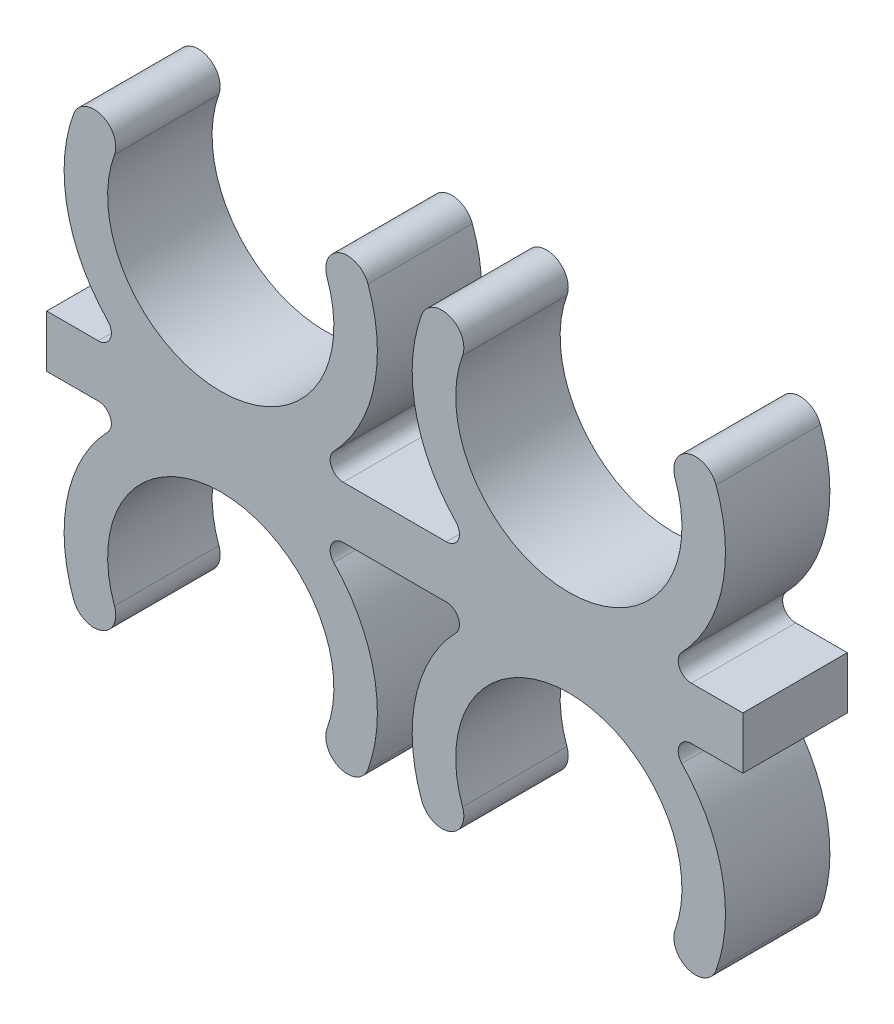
from build123d import *
from build123d.topology import SkipClean

# Parameters (mm, degrees)
BOSS_EXTRUDE1_DEPTH = 6
SKETCH2_W           = 20
SKETCH2_H           = 3
BOSS_EXTRUDE2_DEPTH = 6
SKETCH4_W           = 20
SKETCH4_H           = 3
BOSS_EXTRUDE3_DEPTH = 6
SKETCH5_W           = 20
SKETCH5_H           = 4.5
CUT_EXTRUDE1_DEPTH  = 18.839562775
FILLET1_R           = 0.75


with BuildPart() as part:
    # Sketch1 → Boss-Extrude1 (new body)
    with BuildSketch(Plane.XY):
        with BuildLine():
            Line((0, -6.5), (0, -13.5))
            Line((0, -13.5), (-4, -13.5))
            Line((-4, -13.5), (-4, -10.5))
            Line((-4, -10.5), (-3.5, -10.5))
            ThreePointArc((-3.5, -10.5), (-2.792893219, -10.207106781), (-2.5, -9.5))
            Line((-2.5, -9.5), (-2.5, -9.367496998))
            ThreePointArc((-2.5, -9.367496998), (-2.678416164, -8.797409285), (-3.15, -8.430747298))
            ThreePointArc((-3.15, -8.430747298), (-8.172871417, -3.768842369), (-8.457233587, 3.07818129))
            ThreePointArc((-8.457233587, 3.07818129), (-6.855092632, 3.825271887), (-6.108002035, 2.223130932))
            ThreePointArc((-6.108002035, 2.223130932), (-5.324488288, -3.728246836), (0, -6.5))
        make_face()
    boss_extrude1 = extrude(amount=BOSS_EXTRUDE1_DEPTH)

    # Mirror1: Boss-Extrude1 across plane
    with SkipClean():  # the faces are left unmerged after this step: merging them gives an invalid solid
        add(boss_extrude1.mirror(Plane(origin=(0, -6.5, 6), x_dir=(0, 0, 1), z_dir=(-1, 0, 0))))

    # Sketch2 → Boss-Extrude2 (add)
    with SkipClean():  # the faces are left unmerged after this step: merging them gives an invalid solid
        with BuildSketch(Plane.XY.offset(6)):
            with Locations((0, -12)):
                Rectangle(SKETCH2_W, SKETCH2_H)
        extrude(amount=-BOSS_EXTRUDE2_DEPTH)

    # Sketch4 → Boss-Extrude3 (add)
    with SkipClean():  # the faces are left unmerged after this step: merging them gives an invalid solid
        with BuildSketch(Plane.XY.offset(6)):
            with Locations((0, -9)):
                Rectangle(SKETCH4_W, SKETCH4_H)
        extrude(amount=-BOSS_EXTRUDE3_DEPTH)

    # Sketch5 → Cut-Extrude1 (cut, through all)
    with SkipClean():  # the faces are left unmerged after this step: merging them gives an invalid solid
        with BuildSketch(Plane.XY.offset(6)):
            with Locations((0, -11.25)):
                Rectangle(SKETCH5_W, SKETCH5_H)
        extrude(amount=-CUT_EXTRUDE1_DEPTH, mode=Mode.SUBTRACT)

    # Fillet1
    fillet1_edges = [part.edges().sort_by_distance(p)[0] for p in [
        (4.974937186, -7.5, 3),
        (-4.974937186, -7.5, 3),
    ]]
    fillet(fillet1_edges, radius=FILLET1_R)

    # Mirror2: part across plane


with BuildPart() as part_1:
    with SkipClean():  # the faces are left unmerged after this step: merging them gives an invalid solid
        add(part.part)
        add(part.part.mirror(Plane(origin=(10, -13.5, 0), x_dir=(0, 0, 1), z_dir=(1, 0, 0))))

    # Mirror3: part across plane


with BuildPart() as part_2:
    with SkipClean():  # the faces are left unmerged after this step: merging them gives an invalid solid
        add(part_1.part)
        add(part_1.part.mirror(Plane(origin=(-10, -9, 0), x_dir=(0, 0, 1), z_dir=(0, 1, 0))))


solid = part_2.part
